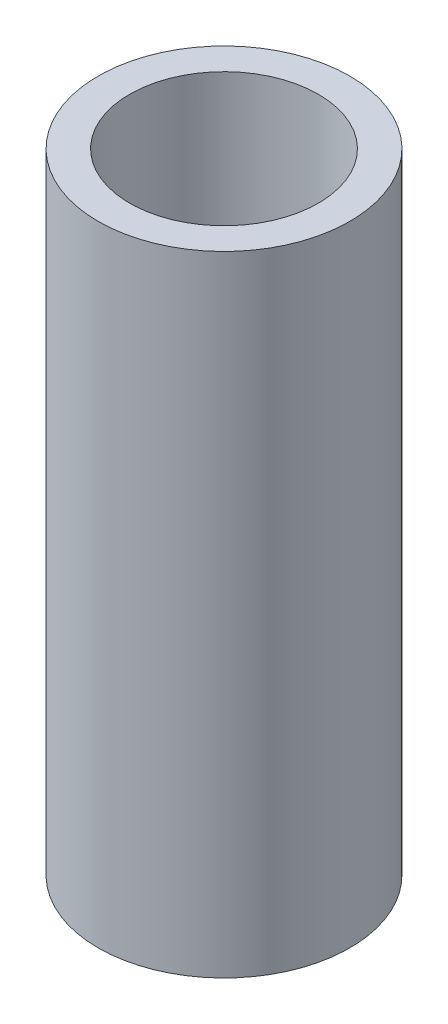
ISO-10303-21;
HEADER;
FILE_DESCRIPTION(('STEP AP214'),'2;1');
FILE_NAME('part.step','',(''),(''),'','','');
FILE_SCHEMA(('AUTOMOTIVE_DESIGN { 1 0 10303 214 1 1 1 1 }'));
ENDSEC;
DATA;
#1=APPLICATION_CONTEXT('core data for automotive mechanical design processes');
#2=APPLICATION_PROTOCOL_DEFINITION('international standard','automotive_design',2000,#1);
#3=PRODUCT_CONTEXT('',#1,'mechanical');
#4=PRODUCT('Part','Part','',(#3));
#5=PRODUCT_RELATED_PRODUCT_CATEGORY('part','',(#4));
#6=PRODUCT_DEFINITION_FORMATION('','',#4);
#7=PRODUCT_DEFINITION_CONTEXT('part definition',#1,'design');
#8=PRODUCT_DEFINITION('design','',#6,#7);
#9=PRODUCT_DEFINITION_SHAPE('','',#8);
#10=(LENGTH_UNIT() NAMED_UNIT(*) SI_UNIT(.MILLI.,.METRE.));
#11=(NAMED_UNIT(*) PLANE_ANGLE_UNIT() SI_UNIT($,.RADIAN.));
#12=(NAMED_UNIT(*) SI_UNIT($,.STERADIAN.) SOLID_ANGLE_UNIT());
#13=UNCERTAINTY_MEASURE_WITH_UNIT(LENGTH_MEASURE(1.E-05),#10,'distance_accuracy_value','');
#14=(GEOMETRIC_REPRESENTATION_CONTEXT(3) GLOBAL_UNCERTAINTY_ASSIGNED_CONTEXT((#13)) GLOBAL_UNIT_ASSIGNED_CONTEXT((#10,
#11,#12)) REPRESENTATION_CONTEXT('',''));
#15=CARTESIAN_POINT('',(0.,0.,0.));
#16=DIRECTION('',(0.,0.,1.));
#17=DIRECTION('',(1.,0.,0.));
#18=AXIS2_PLACEMENT_3D('',#15,#16,#17);
#19=CARTESIAN_POINT('',(0.,406.4,0.));
#20=DIRECTION('',(0.,-1.,0.));
#21=DIRECTION('',(0.,0.,-1.));
#22=AXIS2_PLACEMENT_3D('',#19,#20,#21);
#23=CYLINDRICAL_SURFACE('',#22,25.4);
#24=CARTESIAN_POINT('',(0.,0.,0.));
#25=DIRECTION('',(0.,1.,0.));
#26=DIRECTION('',(0.,0.,1.));
#27=AXIS2_PLACEMENT_3D('',#24,#25,#26);
#28=CIRCLE('',#27,25.4);
#29=CARTESIAN_POINT('',(0.,0.,25.4));
#30=VERTEX_POINT('',#29);
#31=EDGE_CURVE('E10',#30,#30,#28,.T.);
#32=ORIENTED_EDGE('',*,*,#31,.T.);
#33=EDGE_LOOP('',(#32));
#34=FACE_BOUND('',#33,.T.);
#35=CARTESIAN_POINT('',(0.,127.,0.));
#36=DIRECTION('',(0.,-1.,0.));
#37=DIRECTION('',(0.,0.,-1.));
#38=AXIS2_PLACEMENT_3D('',#35,#36,#37);
#39=CIRCLE('',#38,25.4);
#40=CARTESIAN_POINT('',(0.,127.,-25.4));
#41=VERTEX_POINT('',#40);
#42=EDGE_CURVE('E55',#41,#41,#39,.T.);
#43=ORIENTED_EDGE('',*,*,#42,.T.);
#44=EDGE_LOOP('',(#43));
#45=FACE_BOUND('',#44,.T.);
#46=ADVANCED_FACE('F42',(#34,#45),#23,.T.);
#47=CARTESIAN_POINT('',(0.,0.,0.));
#48=DIRECTION('',(0.,1.,0.));
#49=DIRECTION('',(0.,0.,1.));
#50=AXIS2_PLACEMENT_3D('',#47,#48,#49);
#51=PLANE('',#50);
#52=ORIENTED_EDGE('',*,*,#31,.F.);
#53=EDGE_LOOP('',(#52));
#54=FACE_BOUND('',#53,.T.);
#55=CARTESIAN_POINT('',(0.,0.,0.));
#56=DIRECTION('',(0.,1.,0.));
#57=DIRECTION('',(0.,0.,1.));
#58=AXIS2_PLACEMENT_3D('',#55,#56,#57);
#59=CIRCLE('',#58,19.05);
#60=CARTESIAN_POINT('',(0.,0.,19.05));
#61=VERTEX_POINT('',#60);
#62=EDGE_CURVE('E50',#61,#61,#59,.T.);
#63=ORIENTED_EDGE('',*,*,#62,.T.);
#64=EDGE_LOOP('',(#63));
#65=FACE_BOUND('',#64,.T.);
#66=ADVANCED_FACE('F72',(#54,#65),#51,.F.);
#67=CARTESIAN_POINT('',(0.,406.4,0.));
#68=DIRECTION('',(0.,-1.,0.));
#69=DIRECTION('',(0.,0.,-1.));
#70=AXIS2_PLACEMENT_3D('',#67,#68,#69);
#71=CYLINDRICAL_SURFACE('',#70,19.05);
#72=CARTESIAN_POINT('',(0.,127.,0.));
#73=DIRECTION('',(0.,-1.,0.));
#74=DIRECTION('',(0.,0.,-1.));
#75=AXIS2_PLACEMENT_3D('',#72,#73,#74);
#76=CIRCLE('',#75,19.05);
#77=CARTESIAN_POINT('',(0.,127.,-19.05));
#78=VERTEX_POINT('',#77);
#79=EDGE_CURVE('E45',#78,#78,#76,.T.);
#80=ORIENTED_EDGE('',*,*,#79,.F.);
#81=EDGE_LOOP('',(#80));
#82=FACE_BOUND('',#81,.T.);
#83=ORIENTED_EDGE('',*,*,#62,.F.);
#84=EDGE_LOOP('',(#83));
#85=FACE_BOUND('',#84,.T.);
#86=ADVANCED_FACE('F69',(#82,#85),#71,.F.);
#87=CARTESIAN_POINT('',(-25.4,127.,25.4));
#88=DIRECTION('',(0.,-1.,0.));
#89=DIRECTION('',(0.,0.,-1.));
#90=AXIS2_PLACEMENT_3D('',#87,#88,#89);
#91=PLANE('',#90);
#92=ORIENTED_EDGE('',*,*,#79,.T.);
#93=EDGE_LOOP('',(#92));
#94=FACE_BOUND('',#93,.T.);
#95=ORIENTED_EDGE('',*,*,#42,.F.);
#96=EDGE_LOOP('',(#95));
#97=FACE_BOUND('',#96,.T.);
#98=ADVANCED_FACE('F66',(#94,#97),#91,.F.);
#99=CLOSED_SHELL('',(#46,#66,#86,#98));
#100=MANIFOLD_SOLID_BREP('B2',#99);
#101=ADVANCED_BREP_SHAPE_REPRESENTATION('',(#18,#100),#14);
#102=SHAPE_DEFINITION_REPRESENTATION(#9,#101);
ENDSEC;
END-ISO-10303-21;
